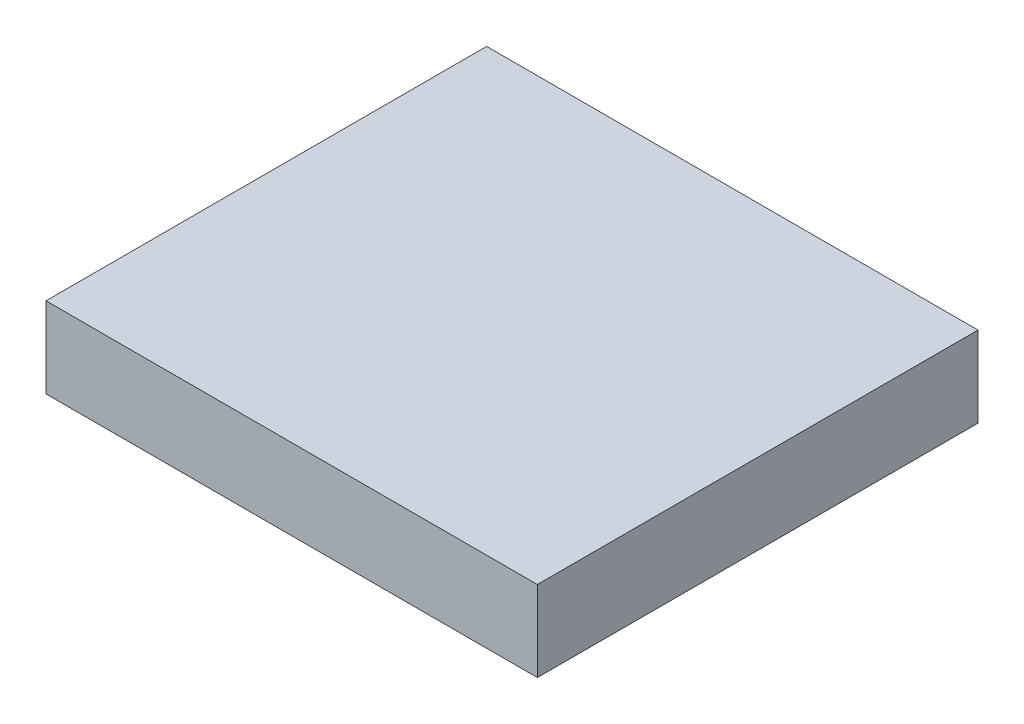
from build123d import *

# Parameters (mm, degrees)
SKETCH1_W      = 226.589879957
SKETCH1_H      = 37.178892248
EXTRUDE2_DEPTH = 203.2


with BuildPart() as part:
    # Sketch1 → Extrude2 (new body)
    with BuildSketch(Plane.XY):
        with Locations((113.294939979, 18.589446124)):
            Rectangle(SKETCH1_W, SKETCH1_H)
    extrude(amount=EXTRUDE2_DEPTH)


solid = part.part
